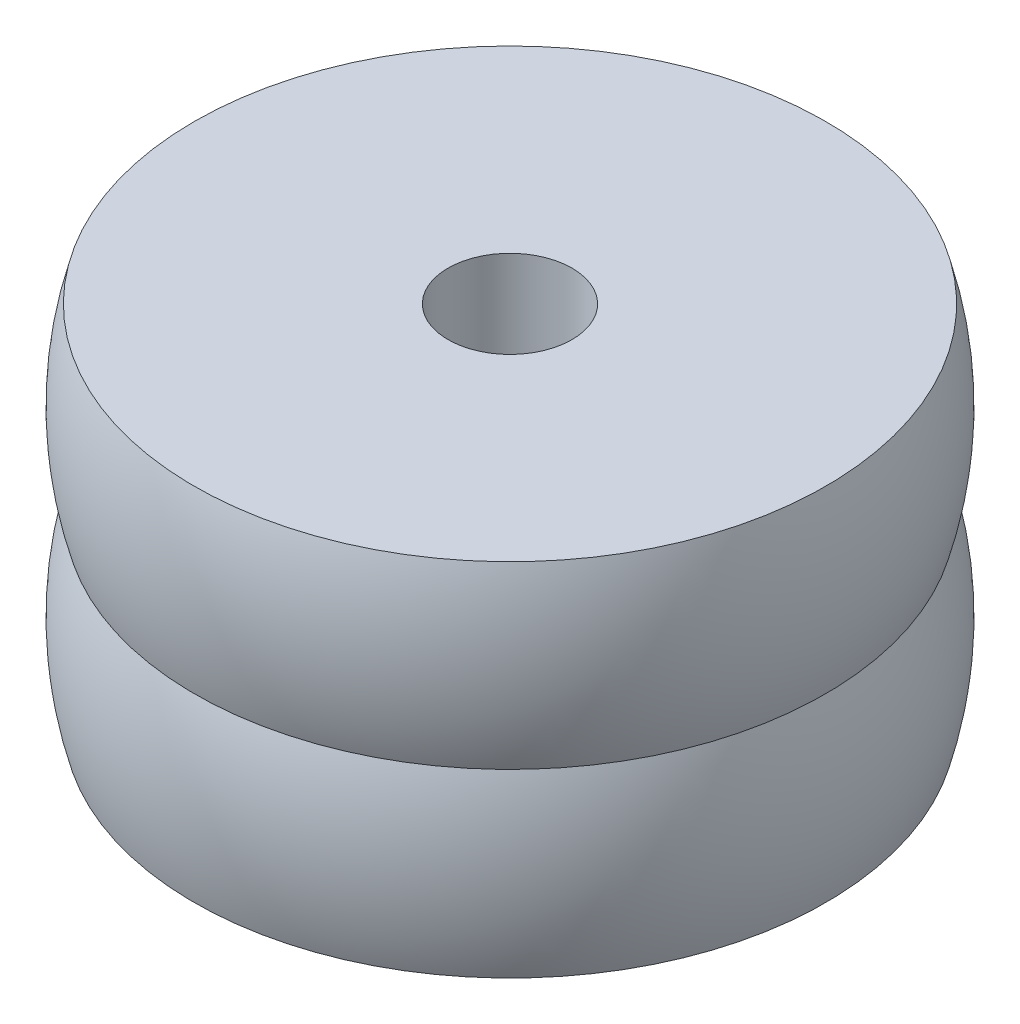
ISO-10303-21;
HEADER;
FILE_DESCRIPTION(('STEP AP214'),'2;1');
FILE_NAME('part.step','',(''),(''),'','','');
FILE_SCHEMA(('AUTOMOTIVE_DESIGN { 1 0 10303 214 1 1 1 1 }'));
ENDSEC;
DATA;
#1=APPLICATION_CONTEXT('core data for automotive mechanical design processes');
#2=APPLICATION_PROTOCOL_DEFINITION('international standard','automotive_design',2000,#1);
#3=PRODUCT_CONTEXT('',#1,'mechanical');
#4=PRODUCT('Part','Part','',(#3));
#5=PRODUCT_RELATED_PRODUCT_CATEGORY('part','',(#4));
#6=PRODUCT_DEFINITION_FORMATION('','',#4);
#7=PRODUCT_DEFINITION_CONTEXT('part definition',#1,'design');
#8=PRODUCT_DEFINITION('design','',#6,#7);
#9=PRODUCT_DEFINITION_SHAPE('','',#8);
#10=(LENGTH_UNIT() NAMED_UNIT(*) SI_UNIT(.MILLI.,.METRE.));
#11=(NAMED_UNIT(*) PLANE_ANGLE_UNIT() SI_UNIT($,.RADIAN.));
#12=(NAMED_UNIT(*) SI_UNIT($,.STERADIAN.) SOLID_ANGLE_UNIT());
#13=UNCERTAINTY_MEASURE_WITH_UNIT(LENGTH_MEASURE(1.E-05),#10,'distance_accuracy_value','');
#14=(GEOMETRIC_REPRESENTATION_CONTEXT(3) GLOBAL_UNCERTAINTY_ASSIGNED_CONTEXT((#13)) GLOBAL_UNIT_ASSIGNED_CONTEXT((#10,
#11,#12)) REPRESENTATION_CONTEXT('',''));
#15=CARTESIAN_POINT('',(0.,0.,0.));
#16=DIRECTION('',(0.,0.,1.));
#17=DIRECTION('',(1.,0.,0.));
#18=AXIS2_PLACEMENT_3D('',#15,#16,#17);
#19=CARTESIAN_POINT('',(0.,37.22,0.));
#20=DIRECTION('',(0.,-1.,0.));
#21=DIRECTION('',(-1.,0.,0.));
#22=AXIS2_PLACEMENT_3D('',#19,#20,#21);
#23=SPHERICAL_SURFACE('',#22,45.);
#24=CARTESIAN_POINT('',(0.,24.72,0.));
#25=DIRECTION('',(0.,-1.,0.));
#26=DIRECTION('',(0.,0.,-1.));
#27=AXIS2_PLACEMENT_3D('',#24,#25,#26);
#28=CIRCLE('',#27,43.2290411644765);
#29=CARTESIAN_POINT('',(-43.2290411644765,24.72,0.));
#30=VERTEX_POINT('',#29);
#31=EDGE_CURVE('E10',#30,#30,#28,.T.);
#32=CARTESIAN_POINT('',(0.,49.4422222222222,0.));
#33=DIRECTION('',(0.,-1.,0.));
#34=DIRECTION('',(0.,0.,-1.));
#35=AXIS2_PLACEMENT_3D('',#32,#33,#34);
#36=CIRCLE('',#35,43.3083973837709);
#37=CARTESIAN_POINT('',(-43.3083973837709,49.4422222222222,0.));
#38=VERTEX_POINT('',#37);
#39=EDGE_CURVE('E48',#38,#38,#36,.T.);
#40=CARTESIAN_POINT('',(-43.2290411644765,24.72,0.));
#41=CARTESIAN_POINT('',(-43.3015075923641,24.9706114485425,0.));
#42=CARTESIAN_POINT('',(-43.3717942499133,25.2218531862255,0.));
#43=CARTESIAN_POINT('',(-43.5079878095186,25.725520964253,0.));
#44=CARTESIAN_POINT('',(-43.5738947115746,25.9779470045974,0.));
#45=CARTESIAN_POINT('',(-43.7013085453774,26.4839071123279,0.));
#46=CARTESIAN_POINT('',(-43.762815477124,26.7374411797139,0.));
#47=CARTESIAN_POINT('',(-43.8814108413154,27.245540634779,0.));
#48=CARTESIAN_POINT('',(-43.9384992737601,27.5001060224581,0.));
#49=CARTESIAN_POINT('',(-44.0482403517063,28.0101911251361,0.));
#50=CARTESIAN_POINT('',(-44.1008929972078,28.265710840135,0.));
#51=CARTESIAN_POINT('',(-44.2017465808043,28.7776273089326,0.));
#52=CARTESIAN_POINT('',(-44.2499475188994,29.0340240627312,0.));
#53=CARTESIAN_POINT('',(-44.3418831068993,29.5476170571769,0.));
#54=CARTESIAN_POINT('',(-44.3856177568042,29.8048132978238,0.));
#55=CARTESIAN_POINT('',(-44.4686075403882,30.319927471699,0.));
#56=CARTESIAN_POINT('',(-44.5078626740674,30.5778454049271,0.));
#57=CARTESIAN_POINT('',(-44.5818815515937,31.0943249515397,0.));
#58=CARTESIAN_POINT('',(-44.6166452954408,31.3528865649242,0.));
#59=CARTESIAN_POINT('',(-44.6816708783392,31.8705752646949,0.));
#60=CARTESIAN_POINT('',(-44.7119327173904,32.1297023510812,0.));
#61=CARTESIAN_POINT('',(-44.7679453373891,32.6484436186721,0.));
#62=CARTESIAN_POINT('',(-44.7936961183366,32.9080577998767,0.));
#63=CARTESIAN_POINT('',(-44.8406788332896,33.4276947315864,0.));
#64=CARTESIAN_POINT('',(-44.8619107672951,33.6877174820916,0.));
#65=CARTESIAN_POINT('',(-44.8998493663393,34.2080929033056,0.));
#66=CARTESIAN_POINT('',(-44.916556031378,34.4684455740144,0.));
#67=CARTESIAN_POINT('',(-44.9454390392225,34.9894020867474,0.));
#68=CARTESIAN_POINT('',(-44.9576153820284,35.2500059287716,0.));
#69=CARTESIAN_POINT('',(-44.9774340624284,35.7713859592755,0.));
#70=CARTESIAN_POINT('',(-44.9850764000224,36.0321621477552,0.));
#71=CARTESIAN_POINT('',(-44.9958247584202,36.5538079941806,0.));
#72=CARTESIAN_POINT('',(-44.998930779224,36.8146776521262,0.));
#73=CARTESIAN_POINT('',(-45.000605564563,37.3364315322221,0.));
#74=CARTESIAN_POINT('',(-44.9991743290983,37.5973157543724,0.));
#75=CARTESIAN_POINT('',(-44.9917750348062,38.1190198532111,0.));
#76=CARTESIAN_POINT('',(-44.9858069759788,38.3798397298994,0.));
#77=CARTESIAN_POINT('',(-44.9693358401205,38.9013362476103,0.));
#78=CARTESIAN_POINT('',(-44.9588327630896,39.1620128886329,0.));
#79=CARTESIAN_POINT('',(-44.9332947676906,39.6831440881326,0.));
#80=CARTESIAN_POINT('',(-44.9182598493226,39.9435986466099,0.));
#81=CARTESIAN_POINT('',(-44.8836627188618,40.4642069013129,0.));
#82=CARTESIAN_POINT('',(-44.8641005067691,40.7243605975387,0.));
#83=CARTESIAN_POINT('',(-44.8204547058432,41.2442884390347,0.));
#84=CARTESIAN_POINT('',(-44.7963711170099,41.5040625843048,0.));
#85=CARTESIAN_POINT('',(-44.7436898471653,42.0231527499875,0.));
#86=CARTESIAN_POINT('',(-44.715092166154,42.2824687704,0.));
#87=CARTESIAN_POINT('',(-44.6533913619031,42.8005642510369,0.));
#88=CARTESIAN_POINT('',(-44.6202882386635,43.0593437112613,0.));
#89=CARTESIAN_POINT('',(-44.549586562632,43.5762877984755,0.));
#90=CARTESIAN_POINT('',(-44.5119880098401,43.8344524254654,0.));
#91=CARTESIAN_POINT('',(-44.4323068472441,44.3500887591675,0.));
#92=CARTESIAN_POINT('',(-44.3902242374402,44.6075604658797,0.));
#93=CARTESIAN_POINT('',(-44.3015876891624,45.1217330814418,0.));
#94=CARTESIAN_POINT('',(-44.2550337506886,45.3784339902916,0.));
#95=CARTESIAN_POINT('',(-44.1574686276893,45.8909873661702,0.));
#96=CARTESIAN_POINT('',(-44.1064574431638,46.1468398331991,0.));
#97=CARTESIAN_POINT('',(-43.9999932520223,46.6576189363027,0.));
#98=CARTESIAN_POINT('',(-43.9445402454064,46.9125455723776,0.));
#99=CARTESIAN_POINT('',(-43.8292092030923,47.4213959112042,0.));
#100=CARTESIAN_POINT('',(-43.7693311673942,47.6753196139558,0.));
#101=CARTESIAN_POINT('',(-43.6451681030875,48.1820872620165,0.));
#102=CARTESIAN_POINT('',(-43.580883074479,48.4349312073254,0.));
#103=CARTESIAN_POINT('',(-43.4479257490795,48.9394629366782,0.));
#104=CARTESIAN_POINT('',(-43.3792534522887,49.1911507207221,0.));
#105=CARTESIAN_POINT('',(-43.3083973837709,49.4422222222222,0.));
#106=B_SPLINE_CURVE_WITH_KNOTS('',3,(#40,#41,#42,#43,#44,#45,#46,#47,#48,#49,#50,#51,#52,#53,
#54,#55,#56,#57,#58,#59,#60,#61,#62,#63,#64,#65,#66,#67,#68,#69,#70,#71,#72,#73,#74,#75,#76,#77,
#78,#79,#80,#81,#82,#83,#84,#85,#86,#87,#88,#89,#90,#91,#92,#93,#94,#95,#96,#97,#98,#99,#100,
#101,#102,#103,#104,#105),.UNSPECIFIED.,.F.,.F.,(4,2,2,2,2,2,2,2,2,2,2,2,2,2,2,2,2,2,2,2,2,2,2,
2,2,2,2,2,2,2,2,2,4),(0.,0.782624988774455,1.56524997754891,2.34787496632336,3.13049995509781,
3.91312494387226,4.69574993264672,5.47837492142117,6.26099991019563,7.04362489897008,
7.82624988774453,8.60887487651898,9.39149986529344,10.1741248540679,10.9567498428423,
11.7393748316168,12.5219998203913,13.3046248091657,14.0872497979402,14.8698747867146,
15.6524997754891,16.4351247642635,17.217749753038,18.0003747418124,18.7829997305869,
19.5656247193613,20.3482497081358,21.1308746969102,21.9134996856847,22.6961246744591,
23.4787496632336,24.2613746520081,25.0439996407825),.UNSPECIFIED.);
#107=EDGE_CURVE('BSEAM29',#30,#38,#106,.T.);
#108=ORIENTED_EDGE('',*,*,#31,.F.);
#109=ORIENTED_EDGE('',*,*,#39,.T.);
#110=ORIENTED_EDGE('',*,*,#107,.T.);
#111=ORIENTED_EDGE('',*,*,#107,.F.);
#112=EDGE_LOOP('',(#108,#110,#109,#111));
#113=FACE_BOUND('',#112,.T.);
#114=ADVANCED_FACE('F29',(#113),#23,.T.);
#115=CARTESIAN_POINT('',(0.,12.22,0.));
#116=DIRECTION('',(0.,-1.,0.));
#117=DIRECTION('',(-1.,0.,0.));
#118=AXIS2_PLACEMENT_3D('',#115,#116,#117);
#119=SPHERICAL_SURFACE('',#118,45.);
#120=CARTESIAN_POINT('',(0.,0.,0.));
#121=DIRECTION('',(0.,-1.,0.));
#122=DIRECTION('',(0.,0.,-1.));
#123=AXIS2_PLACEMENT_3D('',#120,#121,#122);
#124=CIRCLE('',#123,43.3090244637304);
#125=CARTESIAN_POINT('',(-43.3090244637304,0.,0.));
#126=VERTEX_POINT('',#125);
#127=EDGE_CURVE('E35',#126,#126,#124,.T.);
#128=CARTESIAN_POINT('',(-43.3090244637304,0.,0.));
#129=CARTESIAN_POINT('',(-43.3798611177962,0.251051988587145,0.));
#130=CARTESIAN_POINT('',(-43.4485143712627,0.502720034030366,0.));
#131=CARTESIAN_POINT('',(-43.5814343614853,1.0072118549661,0.));
#132=CARTESIAN_POINT('',(-43.6457010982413,1.26003563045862,0.));
#133=CARTESIAN_POINT('',(-43.7698283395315,1.76676252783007,0.));
#134=CARTESIAN_POINT('',(-43.8296888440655,2.02066564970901,0.));
#135=CARTESIAN_POINT('',(-43.9449855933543,2.52947443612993,0.));
#136=CARTESIAN_POINT('',(-44.000421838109,2.78438010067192,0.));
#137=CARTESIAN_POINT('',(-44.1068532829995,3.29511689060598,0.));
#138=CARTESIAN_POINT('',(-44.1578484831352,3.55094801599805,0.));
#139=CARTESIAN_POINT('',(-44.2553824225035,4.06345835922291,0.));
#140=CARTESIAN_POINT('',(-44.301921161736,4.3201375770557,0.));
#141=CARTESIAN_POINT('',(-44.3905281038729,4.83426648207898,0.));
#142=CARTESIAN_POINT('',(-44.4325963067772,5.09171616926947,0.));
#143=CARTESIAN_POINT('',(-44.5122494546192,5.60730815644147,0.));
#144=CARTESIAN_POINT('',(-44.5498343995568,5.86545045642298,0.));
#145=CARTESIAN_POINT('',(-44.6205096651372,6.38234960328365,0.));
#146=CARTESIAN_POINT('',(-44.6535999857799,6.64110645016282,0.));
#147=CARTESIAN_POINT('',(-44.7152759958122,7.15915643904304,0.));
#148=CARTESIAN_POINT('',(-44.7438616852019,7.41844958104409,0.));
#149=CARTESIAN_POINT('',(-44.7965197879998,7.93749374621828,0.));
#150=CARTESIAN_POINT('',(-44.8205922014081,8.19724476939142,0.));
#151=CARTESIAN_POINT('',(-44.8642164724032,8.71712614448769,0.));
#152=CARTESIAN_POINT('',(-44.8837683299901,8.97725649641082,0.));
#153=CARTESIAN_POINT('',(-44.918345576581,9.49781786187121,0.));
#154=CARTESIAN_POINT('',(-44.9333709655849,9.75824887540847,0.));
#155=CARTESIAN_POINT('',(-44.9588907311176,10.2793328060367,0.));
#156=CARTESIAN_POINT('',(-44.9693851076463,10.5399857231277,0.));
#157=CARTESIAN_POINT('',(-44.9858396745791,11.0614346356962,0.));
#158=CARTESIAN_POINT('',(-44.9917998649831,11.3222306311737,0.));
#159=CARTESIAN_POINT('',(-44.9991842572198,11.8438868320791,0.));
#160=CARTESIAN_POINT('',(-45.0006084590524,12.104747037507,0.));
#161=CARTESIAN_POINT('',(-44.9989204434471,12.6264527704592,0.));
#162=CARTESIAN_POINT('',(-44.9958082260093,12.8872982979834,0.));
#163=CARTESIAN_POINT('',(-44.9850483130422,13.4088957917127,0.));
#164=CARTESIAN_POINT('',(-44.977400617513,13.6696477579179,0.));
#165=CARTESIAN_POINT('',(-44.9575720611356,14.1909792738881,0.));
#166=CARTESIAN_POINT('',(-44.9453912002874,14.4515588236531,0.));
#167=CARTESIAN_POINT('',(-44.9164999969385,14.9724667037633,0.));
#168=CARTESIAN_POINT('',(-44.8997896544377,15.2327950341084,0.));
#169=CARTESIAN_POINT('',(-44.8618445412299,15.7531217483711,0.));
#170=CARTESIAN_POINT('',(-44.8406097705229,16.0131201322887,0.));
#171=CARTESIAN_POINT('',(-44.7936222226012,16.5327083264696,0.));
#172=CARTESIAN_POINT('',(-44.7678694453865,16.7922981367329,0.));
#173=CARTESIAN_POINT('',(-44.7118536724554,17.310990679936,0.));
#174=CARTESIAN_POINT('',(-44.6815906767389,17.5700934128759,0.));
#175=CARTESIAN_POINT('',(-44.6165636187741,18.0877334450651,0.));
#176=CARTESIAN_POINT('',(-44.5817995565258,18.3462707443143,0.));
#177=CARTESIAN_POINT('',(-44.5077808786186,18.8627017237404,0.));
#178=CARTESIAN_POINT('',(-44.4685262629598,19.1205954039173,0.));
#179=CARTESIAN_POINT('',(-44.3855383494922,19.6356611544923,0.));
#180=CARTESIAN_POINT('',(-44.3418050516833,19.8928332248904,0.));
#181=CARTESIAN_POINT('',(-44.2498729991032,20.4063779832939,0.));
#182=CARTESIAN_POINT('',(-44.2016742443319,20.6627506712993,0.));
#183=CARTESIAN_POINT('',(-44.1008258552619,21.1746191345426,0.));
#184=CARTESIAN_POINT('',(-44.0481762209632,21.4301149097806,0.));
#185=CARTESIAN_POINT('',(-43.9384419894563,21.9401522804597,0.));
#186=CARTESIAN_POINT('',(-43.8813573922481,22.1946938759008,0.));
#187=CARTESIAN_POINT('',(-43.7627705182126,22.7027459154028,0.));
#188=CARTESIAN_POINT('',(-43.7012682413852,22.9562563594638,0.));
#189=CARTESIAN_POINT('',(-43.5738645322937,23.462169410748,0.));
#190=CARTESIAN_POINT('',(-43.5079631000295,23.7145720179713,0.));
#191=CARTESIAN_POINT('',(-43.3717812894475,24.218193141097,0.));
#192=CARTESIAN_POINT('',(-43.3015009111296,24.4694116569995,0.));
#193=CARTESIAN_POINT('',(-43.2290411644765,24.72,0.));
#194=B_SPLINE_CURVE_WITH_KNOTS('',3,(#128,#129,#130,#131,#132,#133,#134,#135,#136,#137,#138,
#139,#140,#141,#142,#143,#144,#145,#146,#147,#148,#149,#150,#151,#152,#153,#154,#155,#156,#157,
#158,#159,#160,#161,#162,#163,#164,#165,#166,#167,#168,#169,#170,#171,#172,#173,#174,#175,#176,
#177,#178,#179,#180,#181,#182,#183,#184,#185,#186,#187,#188,#189,#190,#191,#192,#193),
.UNSPECIFIED.,.F.,.F.,(4,2,2,2,2,2,2,2,2,2,2,2,2,2,2,2,2,2,2,2,2,2,2,2,2,2,2,2,2,2,2,2,4),(0.,
0.782552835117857,1.56510567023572,2.34765850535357,3.13021134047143,3.91276417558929,
4.69531701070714,5.477869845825,6.26042268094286,7.04297551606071,7.82552835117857,
8.60808118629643,9.39063402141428,10.1731868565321,10.95573969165,11.7382925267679,
12.5208453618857,13.3033981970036,14.0859510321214,14.8685038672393,15.6510567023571,
16.433609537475,17.2161623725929,17.9987152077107,18.7812680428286,19.5638208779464,
20.3463737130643,21.1289265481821,21.9114793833,22.6940322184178,23.4765850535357,
24.2591378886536,25.0416907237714),.UNSPECIFIED.);
#195=EDGE_CURVE('BSEAM67',#126,#30,#194,.T.);
#196=ORIENTED_EDGE('',*,*,#127,.F.);
#197=ORIENTED_EDGE('',*,*,#31,.T.);
#198=ORIENTED_EDGE('',*,*,#195,.T.);
#199=ORIENTED_EDGE('',*,*,#195,.F.);
#200=EDGE_LOOP('',(#196,#198,#197,#199));
#201=FACE_BOUND('',#200,.T.);
#202=ADVANCED_FACE('F67',(#201),#119,.T.);
#203=CARTESIAN_POINT('',(-43.3090244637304,0.,0.));
#204=DIRECTION('',(0.,1.,0.));
#205=DIRECTION('',(0.,0.,1.));
#206=AXIS2_PLACEMENT_3D('',#203,#204,#205);
#207=PLANE('',#206);
#208=CARTESIAN_POINT('',(0.,0.,0.));
#209=DIRECTION('',(0.,-1.,0.));
#210=DIRECTION('',(0.,0.,-1.));
#211=AXIS2_PLACEMENT_3D('',#208,#209,#210);
#212=CIRCLE('',#211,8.5);
#213=CARTESIAN_POINT('',(0.,0.,-8.5));
#214=VERTEX_POINT('',#213);
#215=EDGE_CURVE('E39',#214,#214,#212,.T.);
#216=ORIENTED_EDGE('',*,*,#215,.F.);
#217=EDGE_LOOP('',(#216));
#218=FACE_BOUND('',#217,.T.);
#219=ORIENTED_EDGE('',*,*,#127,.T.);
#220=EDGE_LOOP('',(#219));
#221=FACE_BOUND('',#220,.T.);
#222=ADVANCED_FACE('F62',(#218,#221),#207,.F.);
#223=CARTESIAN_POINT('',(0.,-3.07763206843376,0.));
#224=DIRECTION('',(0.,-1.,0.));
#225=DIRECTION('',(0.,0.,-1.));
#226=AXIS2_PLACEMENT_3D('',#223,#224,#225);
#227=CYLINDRICAL_SURFACE('',#226,8.5);
#228=CARTESIAN_POINT('',(0.,49.4422222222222,0.));
#229=DIRECTION('',(0.,-1.,0.));
#230=DIRECTION('',(0.,0.,-1.));
#231=AXIS2_PLACEMENT_3D('',#228,#229,#230);
#232=CIRCLE('',#231,8.50000000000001);
#233=CARTESIAN_POINT('',(0.,49.4422222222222,-8.50000000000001));
#234=VERTEX_POINT('',#233);
#235=EDGE_CURVE('E43',#234,#234,#232,.T.);
#236=ORIENTED_EDGE('',*,*,#235,.F.);
#237=EDGE_LOOP('',(#236));
#238=FACE_BOUND('',#237,.T.);
#239=ORIENTED_EDGE('',*,*,#215,.T.);
#240=EDGE_LOOP('',(#239));
#241=FACE_BOUND('',#240,.T.);
#242=ADVANCED_FACE('F56',(#238,#241),#227,.F.);
#243=CARTESIAN_POINT('',(-43.3083973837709,49.4422222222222,0.));
#244=DIRECTION('',(0.,-1.,0.));
#245=DIRECTION('',(0.,0.,-1.));
#246=AXIS2_PLACEMENT_3D('',#243,#244,#245);
#247=PLANE('',#246);
#248=ORIENTED_EDGE('',*,*,#39,.F.);
#249=EDGE_LOOP('',(#248));
#250=FACE_BOUND('',#249,.T.);
#251=ORIENTED_EDGE('',*,*,#235,.T.);
#252=EDGE_LOOP('',(#251));
#253=FACE_BOUND('',#252,.T.);
#254=ADVANCED_FACE('F53',(#250,#253),#247,.F.);
#255=CLOSED_SHELL('',(#114,#202,#222,#242,#254));
#256=MANIFOLD_SOLID_BREP('B2',#255);
#257=ADVANCED_BREP_SHAPE_REPRESENTATION('',(#18,#256),#14);
#258=SHAPE_DEFINITION_REPRESENTATION(#9,#257);
ENDSEC;
END-ISO-10303-21;
